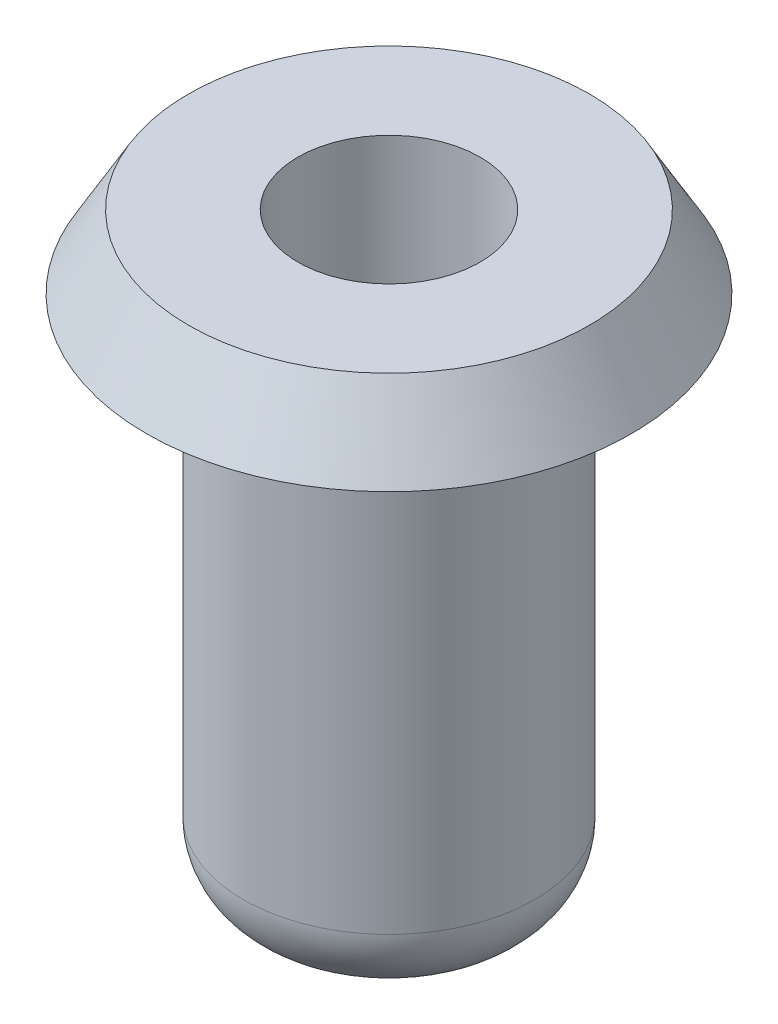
ISO-10303-21;
HEADER;
FILE_DESCRIPTION(('STEP AP214'),'2;1');
FILE_NAME('part.step','',(''),(''),'','','');
FILE_SCHEMA(('AUTOMOTIVE_DESIGN { 1 0 10303 214 1 1 1 1 }'));
ENDSEC;
DATA;
#1=APPLICATION_CONTEXT('core data for automotive mechanical design processes');
#2=APPLICATION_PROTOCOL_DEFINITION('international standard','automotive_design',2000,#1);
#3=PRODUCT_CONTEXT('',#1,'mechanical');
#4=PRODUCT('Part','Part','',(#3));
#5=PRODUCT_RELATED_PRODUCT_CATEGORY('part','',(#4));
#6=PRODUCT_DEFINITION_FORMATION('','',#4);
#7=PRODUCT_DEFINITION_CONTEXT('part definition',#1,'design');
#8=PRODUCT_DEFINITION('design','',#6,#7);
#9=PRODUCT_DEFINITION_SHAPE('','',#8);
#10=(LENGTH_UNIT() NAMED_UNIT(*) SI_UNIT(.MILLI.,.METRE.));
#11=(NAMED_UNIT(*) PLANE_ANGLE_UNIT() SI_UNIT($,.RADIAN.));
#12=(NAMED_UNIT(*) SI_UNIT($,.STERADIAN.) SOLID_ANGLE_UNIT());
#13=UNCERTAINTY_MEASURE_WITH_UNIT(LENGTH_MEASURE(1.E-05),#10,'distance_accuracy_value','');
#14=(GEOMETRIC_REPRESENTATION_CONTEXT(3) GLOBAL_UNCERTAINTY_ASSIGNED_CONTEXT((#13)) GLOBAL_UNIT_ASSIGNED_CONTEXT((#10,
#11,#12)) REPRESENTATION_CONTEXT('',''));
#15=CARTESIAN_POINT('',(0.,0.,0.));
#16=DIRECTION('',(0.,0.,1.));
#17=DIRECTION('',(1.,0.,0.));
#18=AXIS2_PLACEMENT_3D('',#15,#16,#17);
#19=CARTESIAN_POINT('',(0.,0.,0.));
#20=DIRECTION('',(0.,1.,0.));
#21=DIRECTION('',(0.,0.,1.));
#22=AXIS2_PLACEMENT_3D('',#19,#20,#21);
#23=PLANE('',#22);
#24=CARTESIAN_POINT('',(0.,0.,0.));
#25=DIRECTION('',(0.,-1.,0.));
#26=DIRECTION('',(0.,0.,-1.));
#27=AXIS2_PLACEMENT_3D('',#24,#25,#26);
#28=CIRCLE('',#27,0.999999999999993);
#29=CARTESIAN_POINT('',(0.,0.,-0.999999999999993));
#30=VERTEX_POINT('',#29);
#31=EDGE_CURVE('E10',#30,#30,#28,.T.);
#32=ORIENTED_EDGE('',*,*,#31,.T.);
#33=EDGE_LOOP('',(#32));
#34=FACE_BOUND('',#33,.T.);
#35=ADVANCED_FACE('F32',(#34),#23,.F.);
#36=CARTESIAN_POINT('',(0.,1.,0.));
#37=DIRECTION('',(0.,-1.,0.));
#38=DIRECTION('',(0.,0.,-1.));
#39=AXIS2_PLACEMENT_3D('',#36,#37,#38);
#40=DEGENERATE_TOROIDAL_SURFACE('',#39,1.,1.,.T.);
#41=ORIENTED_EDGE('',*,*,#31,.F.);
#42=EDGE_LOOP('',(#41));
#43=FACE_BOUND('',#42,.T.);
#44=CARTESIAN_POINT('',(0.,1.00000000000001,0.));
#45=DIRECTION('',(0.,-1.,0.));
#46=DIRECTION('',(0.,0.,-1.));
#47=AXIS2_PLACEMENT_3D('',#44,#45,#46);
#48=CIRCLE('',#47,2.);
#49=CARTESIAN_POINT('',(0.,1.00000000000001,-2.));
#50=VERTEX_POINT('',#49);
#51=EDGE_CURVE('E38',#50,#50,#48,.T.);
#52=ORIENTED_EDGE('',*,*,#51,.T.);
#53=EDGE_LOOP('',(#52));
#54=FACE_BOUND('',#53,.T.);
#55=ADVANCED_FACE('F73',(#43,#54),#40,.T.);
#56=CARTESIAN_POINT('',(0.,0.,0.));
#57=DIRECTION('',(0.,-1.,0.));
#58=DIRECTION('',(0.,0.,-1.));
#59=AXIS2_PLACEMENT_3D('',#56,#57,#58);
#60=CYLINDRICAL_SURFACE('',#59,2.);
#61=ORIENTED_EDGE('',*,*,#51,.F.);
#62=EDGE_LOOP('',(#61));
#63=FACE_BOUND('',#62,.T.);
#64=CARTESIAN_POINT('',(0.,7.2,0.));
#65=DIRECTION('',(0.,-1.,0.));
#66=DIRECTION('',(0.,0.,-1.));
#67=AXIS2_PLACEMENT_3D('',#64,#65,#66);
#68=CIRCLE('',#67,2.);
#69=CARTESIAN_POINT('',(0.,7.2,-2.));
#70=VERTEX_POINT('',#69);
#71=EDGE_CURVE('E42',#70,#70,#68,.T.);
#72=ORIENTED_EDGE('',*,*,#71,.T.);
#73=EDGE_LOOP('',(#72));
#74=FACE_BOUND('',#73,.T.);
#75=ADVANCED_FACE('F77',(#63,#74),#60,.T.);
#76=CARTESIAN_POINT('',(-2.,7.2,0.));
#77=DIRECTION('',(0.,1.,0.));
#78=DIRECTION('',(0.,0.,1.));
#79=AXIS2_PLACEMENT_3D('',#76,#77,#78);
#80=PLANE('',#79);
#81=ORIENTED_EDGE('',*,*,#71,.F.);
#82=EDGE_LOOP('',(#81));
#83=FACE_BOUND('',#82,.T.);
#84=CARTESIAN_POINT('',(0.,7.2,0.));
#85=DIRECTION('',(0.,-1.,0.));
#86=DIRECTION('',(0.,0.,-1.));
#87=AXIS2_PLACEMENT_3D('',#84,#85,#86);
#88=CIRCLE('',#87,3.32735026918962);
#89=CARTESIAN_POINT('',(0.,7.2,-3.32735026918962));
#90=VERTEX_POINT('',#89);
#91=EDGE_CURVE('E46',#90,#90,#88,.T.);
#92=ORIENTED_EDGE('',*,*,#91,.T.);
#93=EDGE_LOOP('',(#92));
#94=FACE_BOUND('',#93,.T.);
#95=ADVANCED_FACE('F82',(#83,#94),#80,.F.);
#96=CARTESIAN_POINT('',(0.,8.2,0.));
#97=DIRECTION('',(0.,-1.,0.));
#98=DIRECTION('',(0.,0.,-1.));
#99=AXIS2_PLACEMENT_3D('',#96,#97,#98);
#100=CONICAL_SURFACE('',#99,2.75,0.523598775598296);
#101=ORIENTED_EDGE('',*,*,#91,.F.);
#102=EDGE_LOOP('',(#101));
#103=FACE_BOUND('',#102,.T.);
#104=CARTESIAN_POINT('',(0.,8.2,0.));
#105=DIRECTION('',(0.,-1.,0.));
#106=DIRECTION('',(0.,0.,-1.));
#107=AXIS2_PLACEMENT_3D('',#104,#105,#106);
#108=CIRCLE('',#107,2.75);
#109=CARTESIAN_POINT('',(0.,8.2,-2.75));
#110=VERTEX_POINT('',#109);
#111=EDGE_CURVE('E51',#110,#110,#108,.T.);
#112=ORIENTED_EDGE('',*,*,#111,.T.);
#113=EDGE_LOOP('',(#112));
#114=FACE_BOUND('',#113,.T.);
#115=ADVANCED_FACE('F88',(#103,#114),#100,.T.);
#116=CARTESIAN_POINT('',(-2.75,8.2,0.));
#117=DIRECTION('',(0.,-1.,0.));
#118=DIRECTION('',(0.,0.,-1.));
#119=AXIS2_PLACEMENT_3D('',#116,#117,#118);
#120=PLANE('',#119);
#121=ORIENTED_EDGE('',*,*,#111,.F.);
#122=EDGE_LOOP('',(#121));
#123=FACE_BOUND('',#122,.T.);
#124=CARTESIAN_POINT('',(0.,8.2,0.));
#125=DIRECTION('',(0.,-1.,0.));
#126=DIRECTION('',(0.,0.,-1.));
#127=AXIS2_PLACEMENT_3D('',#124,#125,#126);
#128=CIRCLE('',#127,1.25);
#129=CARTESIAN_POINT('',(0.,8.2,-1.25));
#130=VERTEX_POINT('',#129);
#131=EDGE_CURVE('E54',#130,#130,#128,.T.);
#132=ORIENTED_EDGE('',*,*,#131,.T.);
#133=EDGE_LOOP('',(#132));
#134=FACE_BOUND('',#133,.T.);
#135=ADVANCED_FACE('F69',(#123,#134),#120,.F.);
#136=CARTESIAN_POINT('',(0.,0.,0.));
#137=DIRECTION('',(0.,-1.,0.));
#138=DIRECTION('',(0.,0.,-1.));
#139=AXIS2_PLACEMENT_3D('',#136,#137,#138);
#140=CYLINDRICAL_SURFACE('',#139,1.25);
#141=ORIENTED_EDGE('',*,*,#131,.F.);
#142=EDGE_LOOP('',(#141));
#143=FACE_BOUND('',#142,.T.);
#144=CARTESIAN_POINT('',(0.,2.,0.));
#145=DIRECTION('',(0.,-1.,0.));
#146=DIRECTION('',(0.,0.,-1.));
#147=AXIS2_PLACEMENT_3D('',#144,#145,#146);
#148=CIRCLE('',#147,1.25);
#149=CARTESIAN_POINT('',(0.,2.,-1.25));
#150=VERTEX_POINT('',#149);
#151=EDGE_CURVE('E57',#150,#150,#148,.T.);
#152=ORIENTED_EDGE('',*,*,#151,.T.);
#153=EDGE_LOOP('',(#152));
#154=FACE_BOUND('',#153,.T.);
#155=ADVANCED_FACE('F61',(#143,#154),#140,.F.);
#156=CARTESIAN_POINT('',(-1.25,2.,0.));
#157=DIRECTION('',(0.,-1.,0.));
#158=DIRECTION('',(0.,0.,-1.));
#159=AXIS2_PLACEMENT_3D('',#156,#157,#158);
#160=PLANE('',#159);
#161=ORIENTED_EDGE('',*,*,#151,.F.);
#162=EDGE_LOOP('',(#161));
#163=FACE_BOUND('',#162,.T.);
#164=ADVANCED_FACE('F63',(#163),#160,.F.);
#165=CLOSED_SHELL('',(#35,#55,#75,#95,#115,#135,#155,#164));
#166=MANIFOLD_SOLID_BREP('B2',#165);
#167=ADVANCED_BREP_SHAPE_REPRESENTATION('',(#18,#166),#14);
#168=SHAPE_DEFINITION_REPRESENTATION(#9,#167);
ENDSEC;
END-ISO-10303-21;
